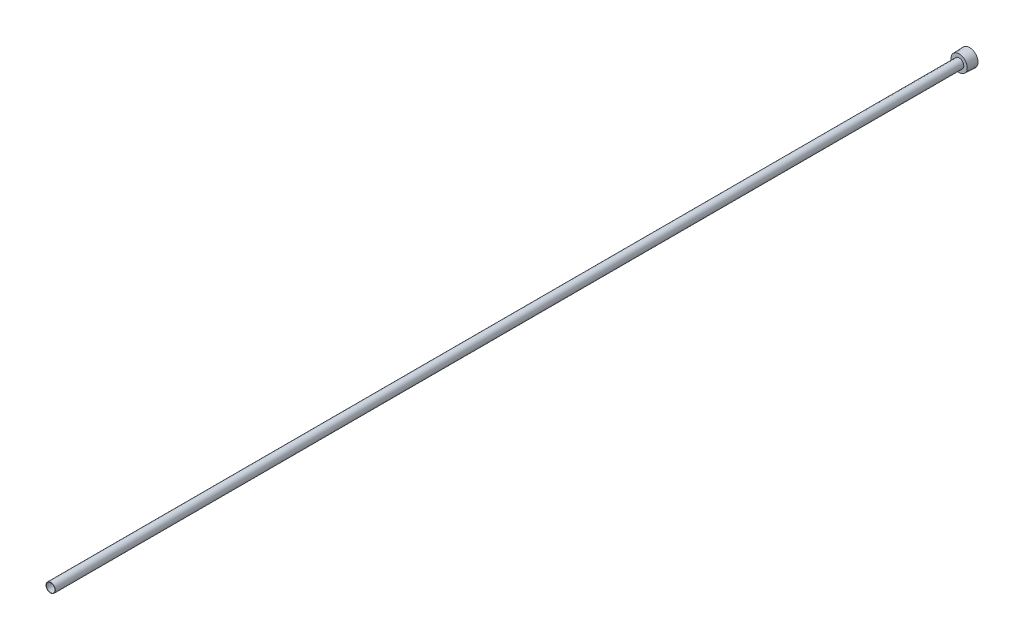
ISO-10303-21;
HEADER;
FILE_DESCRIPTION(('STEP AP214'),'2;1');
FILE_NAME('part.step','',(''),(''),'','','');
FILE_SCHEMA(('AUTOMOTIVE_DESIGN { 1 0 10303 214 1 1 1 1 }'));
ENDSEC;
DATA;
#1=APPLICATION_CONTEXT('core data for automotive mechanical design processes');
#2=APPLICATION_PROTOCOL_DEFINITION('international standard','automotive_design',2000,#1);
#3=PRODUCT_CONTEXT('',#1,'mechanical');
#4=PRODUCT('Part','Part','',(#3));
#5=PRODUCT_RELATED_PRODUCT_CATEGORY('part','',(#4));
#6=PRODUCT_DEFINITION_FORMATION('','',#4);
#7=PRODUCT_DEFINITION_CONTEXT('part definition',#1,'design');
#8=PRODUCT_DEFINITION('design','',#6,#7);
#9=PRODUCT_DEFINITION_SHAPE('','',#8);
#10=(LENGTH_UNIT() NAMED_UNIT(*) SI_UNIT(.MILLI.,.METRE.));
#11=(NAMED_UNIT(*) PLANE_ANGLE_UNIT() SI_UNIT($,.RADIAN.));
#12=(NAMED_UNIT(*) SI_UNIT($,.STERADIAN.) SOLID_ANGLE_UNIT());
#13=UNCERTAINTY_MEASURE_WITH_UNIT(LENGTH_MEASURE(1.E-05),#10,'distance_accuracy_value','');
#14=(GEOMETRIC_REPRESENTATION_CONTEXT(3) GLOBAL_UNCERTAINTY_ASSIGNED_CONTEXT((#13)) GLOBAL_UNIT_ASSIGNED_CONTEXT((#10,
#11,#12)) REPRESENTATION_CONTEXT('',''));
#15=CARTESIAN_POINT('',(0.,0.,0.));
#16=DIRECTION('',(0.,0.,1.));
#17=DIRECTION('',(1.,0.,0.));
#18=AXIS2_PLACEMENT_3D('',#15,#16,#17);
#19=CARTESIAN_POINT('',(0.,0.,0.));
#20=DIRECTION('',(0.,0.,1.));
#21=DIRECTION('',(1.,0.,0.));
#22=AXIS2_PLACEMENT_3D('',#19,#20,#21);
#23=CYLINDRICAL_SURFACE('',#22,4.318);
#24=CARTESIAN_POINT('',(0.,0.,914.4));
#25=DIRECTION('',(0.,0.,1.));
#26=DIRECTION('',(1.,0.,0.));
#27=AXIS2_PLACEMENT_3D('',#24,#25,#26);
#28=CIRCLE('',#27,4.318);
#29=CARTESIAN_POINT('',(4.318,0.,914.4));
#30=VERTEX_POINT('',#29);
#31=EDGE_CURVE('E142',#30,#30,#28,.T.);
#32=ORIENTED_EDGE('',*,*,#31,.T.);
#33=EDGE_LOOP('',(#32));
#34=FACE_BOUND('',#33,.T.);
#35=CARTESIAN_POINT('',(0.,0.,6.35));
#36=DIRECTION('',(0.,0.,-1.));
#37=DIRECTION('',(-1.,0.,0.));
#38=AXIS2_PLACEMENT_3D('',#35,#36,#37);
#39=CIRCLE('',#38,4.318);
#40=CARTESIAN_POINT('',(-4.318,0.,6.35));
#41=VERTEX_POINT('',#40);
#42=EDGE_CURVE('E37',#41,#41,#39,.F.);
#43=ORIENTED_EDGE('',*,*,#42,.F.);
#44=EDGE_LOOP('',(#43));
#45=FACE_BOUND('',#44,.T.);
#46=ADVANCED_FACE('F33',(#34,#45),#23,.F.);
#47=CARTESIAN_POINT('',(0.,0.,0.));
#48=DIRECTION('',(0.,0.,-1.));
#49=DIRECTION('',(-1.,0.,0.));
#50=AXIS2_PLACEMENT_3D('',#47,#48,#49);
#51=CONICAL_SURFACE('',#50,8.4709,0.0364599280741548);
#52=CARTESIAN_POINT('',(0.,0.,10.3124));
#53=DIRECTION('',(0.,0.,1.));
#54=DIRECTION('',(1.,0.,0.));
#55=AXIS2_PLACEMENT_3D('',#52,#53,#54);
#56=CIRCLE('',#55,8.09474394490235);
#57=CARTESIAN_POINT('',(8.09474394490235,0.,10.3124));
#58=VERTEX_POINT('',#57);
#59=EDGE_CURVE('E11',#58,#58,#56,.T.);
#60=ORIENTED_EDGE('',*,*,#59,.F.);
#61=EDGE_LOOP('',(#60));
#62=FACE_BOUND('',#61,.T.);
#63=CARTESIAN_POINT('',(0.,0.,0.));
#64=DIRECTION('',(0.,0.,1.));
#65=DIRECTION('',(1.,0.,0.));
#66=AXIS2_PLACEMENT_3D('',#63,#64,#65);
#67=CIRCLE('',#66,8.4709);
#68=CARTESIAN_POINT('',(8.4709,0.,0.));
#69=VERTEX_POINT('',#68);
#70=EDGE_CURVE('E145',#69,#69,#67,.T.);
#71=ORIENTED_EDGE('',*,*,#70,.T.);
#72=EDGE_LOOP('',(#71));
#73=FACE_BOUND('',#72,.T.);
#74=ADVANCED_FACE('F35',(#62,#73),#51,.T.);
#75=CARTESIAN_POINT('',(0.,8.09474394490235,10.3124));
#76=DIRECTION('',(0.,0.,-1.));
#77=DIRECTION('',(-1.,0.,0.));
#78=AXIS2_PLACEMENT_3D('',#75,#76,#77);
#79=PLANE('',#78);
#80=CARTESIAN_POINT('',(0.,0.,10.3124));
#81=DIRECTION('',(0.,0.,1.));
#82=DIRECTION('',(1.,0.,0.));
#83=AXIS2_PLACEMENT_3D('',#80,#81,#82);
#84=CIRCLE('',#83,4.6355);
#85=CARTESIAN_POINT('',(4.6355,0.,10.3124));
#86=VERTEX_POINT('',#85);
#87=EDGE_CURVE('E42',#86,#86,#84,.T.);
#88=ORIENTED_EDGE('',*,*,#87,.F.);
#89=EDGE_LOOP('',(#88));
#90=FACE_BOUND('',#89,.T.);
#91=ORIENTED_EDGE('',*,*,#59,.T.);
#92=EDGE_LOOP('',(#91));
#93=FACE_BOUND('',#92,.T.);
#94=ADVANCED_FACE('F156',(#90,#93),#79,.F.);
#95=CARTESIAN_POINT('',(0.,0.,168.793426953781));
#96=DIRECTION('',(0.,0.,1.));
#97=DIRECTION('',(1.,0.,0.));
#98=AXIS2_PLACEMENT_3D('',#95,#96,#97);
#99=CYLINDRICAL_SURFACE('',#98,4.63549999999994);
#100=CARTESIAN_POINT('',(0.,0.,914.4));
#101=DIRECTION('',(0.,0.,1.));
#102=DIRECTION('',(1.,0.,0.));
#103=AXIS2_PLACEMENT_3D('',#100,#101,#102);
#104=CIRCLE('',#103,4.63549999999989);
#105=CARTESIAN_POINT('',(4.63549999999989,0.,914.4));
#106=VERTEX_POINT('',#105);
#107=EDGE_CURVE('E148',#106,#106,#104,.T.);
#108=ORIENTED_EDGE('',*,*,#107,.F.);
#109=EDGE_LOOP('',(#108));
#110=FACE_BOUND('',#109,.T.);
#111=ORIENTED_EDGE('',*,*,#87,.T.);
#112=EDGE_LOOP('',(#111));
#113=FACE_BOUND('',#112,.T.);
#114=ADVANCED_FACE('F154',(#110,#113),#99,.T.);
#115=CARTESIAN_POINT('',(0.,4.63549999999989,914.4));
#116=DIRECTION('',(0.,0.,-1.));
#117=DIRECTION('',(-1.,0.,0.));
#118=AXIS2_PLACEMENT_3D('',#115,#116,#117);
#119=PLANE('',#118);
#120=ORIENTED_EDGE('',*,*,#31,.F.);
#121=EDGE_LOOP('',(#120));
#122=FACE_BOUND('',#121,.T.);
#123=ORIENTED_EDGE('',*,*,#107,.T.);
#124=EDGE_LOOP('',(#123));
#125=FACE_BOUND('',#124,.T.);
#126=ADVANCED_FACE('F167',(#122,#125),#119,.F.);
#127=CARTESIAN_POINT('',(0.,0.,0.));
#128=DIRECTION('',(0.,0.,1.));
#129=DIRECTION('',(1.,0.,0.));
#130=AXIS2_PLACEMENT_3D('',#127,#128,#129);
#131=PLANE('',#130);
#132=DIRECTION('',(0.,1.,0.));
#133=VECTOR('',#132,1.);
#134=CARTESIAN_POINT('',(-4.7625,-2.7496306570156,0.));
#135=LINE('',#134,#133);
#136=CARTESIAN_POINT('',(-4.7625,-2.7496306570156,0.));
#137=VERTEX_POINT('',#136);
#138=CARTESIAN_POINT('',(-4.7625,2.74963065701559,0.));
#139=VERTEX_POINT('',#138);
#140=EDGE_CURVE('E124',#137,#139,#135,.T.);
#141=ORIENTED_EDGE('',*,*,#140,.F.);
#142=DIRECTION('',(-0.866025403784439,0.5,0.));
#143=VECTOR('',#142,1.);
#144=CARTESIAN_POINT('',(0.,-5.49926131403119,0.));
#145=LINE('',#144,#143);
#146=CARTESIAN_POINT('',(0.,-5.49926131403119,0.));
#147=VERTEX_POINT('',#146);
#148=EDGE_CURVE('E49',#147,#137,#145,.T.);
#149=ORIENTED_EDGE('',*,*,#148,.F.);
#150=DIRECTION('',(-0.866025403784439,-0.5,0.));
#151=VECTOR('',#150,1.);
#152=CARTESIAN_POINT('',(4.7625,-2.74963065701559,0.));
#153=LINE('',#152,#151);
#154=CARTESIAN_POINT('',(4.7625,-2.74963065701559,0.));
#155=VERTEX_POINT('',#154);
#156=EDGE_CURVE('E133',#155,#147,#153,.T.);
#157=ORIENTED_EDGE('',*,*,#156,.F.);
#158=DIRECTION('',(0.,-1.,0.));
#159=VECTOR('',#158,1.);
#160=CARTESIAN_POINT('',(4.7625,2.74963065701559,0.));
#161=LINE('',#160,#159);
#162=CARTESIAN_POINT('',(4.7625,2.74963065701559,0.));
#163=VERTEX_POINT('',#162);
#164=EDGE_CURVE('E131',#163,#155,#161,.T.);
#165=ORIENTED_EDGE('',*,*,#164,.F.);
#166=DIRECTION('',(0.866025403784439,-0.5,0.));
#167=VECTOR('',#166,1.);
#168=CARTESIAN_POINT('',(0.,5.49926131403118,0.));
#169=LINE('',#168,#167);
#170=CARTESIAN_POINT('',(0.,5.49926131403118,0.));
#171=VERTEX_POINT('',#170);
#172=EDGE_CURVE('E97',#171,#163,#169,.T.);
#173=ORIENTED_EDGE('',*,*,#172,.F.);
#174=DIRECTION('',(0.866025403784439,0.5,0.));
#175=VECTOR('',#174,1.);
#176=CARTESIAN_POINT('',(-4.7625,2.74963065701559,0.));
#177=LINE('',#176,#175);
#178=EDGE_CURVE('E127',#139,#171,#177,.T.);
#179=ORIENTED_EDGE('',*,*,#178,.F.);
#180=EDGE_LOOP('',(#141,#149,#157,#165,#173,#179));
#181=FACE_BOUND('',#180,.T.);
#182=ORIENTED_EDGE('',*,*,#70,.F.);
#183=EDGE_LOOP('',(#182));
#184=FACE_BOUND('',#183,.T.);
#185=ADVANCED_FACE('F165',(#181,#184),#131,.F.);
#186=CARTESIAN_POINT('',(-4.7625,-2.7496306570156,6.35));
#187=DIRECTION('',(0.,0.,-1.));
#188=DIRECTION('',(-1.,0.,0.));
#189=AXIS2_PLACEMENT_3D('',#186,#187,#188);
#190=PLANE('',#189);
#191=DIRECTION('',(-0.866025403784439,0.5,0.));
#192=VECTOR('',#191,1.);
#193=CARTESIAN_POINT('',(0.,-5.49926131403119,6.35));
#194=LINE('',#193,#192);
#195=CARTESIAN_POINT('',(0.,-5.49926131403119,6.35));
#196=VERTEX_POINT('',#195);
#197=CARTESIAN_POINT('',(-4.7625,-2.7496306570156,6.35));
#198=VERTEX_POINT('',#197);
#199=EDGE_CURVE('E135',#196,#198,#194,.T.);
#200=ORIENTED_EDGE('',*,*,#199,.T.);
#201=DIRECTION('',(0.,1.,0.));
#202=VECTOR('',#201,1.);
#203=CARTESIAN_POINT('',(-4.7625,-2.7496306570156,6.35));
#204=LINE('',#203,#202);
#205=CARTESIAN_POINT('',(-4.7625,2.74963065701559,6.35));
#206=VERTEX_POINT('',#205);
#207=EDGE_CURVE('E118',#198,#206,#204,.T.);
#208=ORIENTED_EDGE('',*,*,#207,.T.);
#209=DIRECTION('',(0.866025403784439,0.5,0.));
#210=VECTOR('',#209,1.);
#211=CARTESIAN_POINT('',(-4.7625,2.74963065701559,6.35));
#212=LINE('',#211,#210);
#213=CARTESIAN_POINT('',(0.,5.49926131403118,6.35));
#214=VERTEX_POINT('',#213);
#215=EDGE_CURVE('E116',#206,#214,#212,.T.);
#216=ORIENTED_EDGE('',*,*,#215,.T.);
#217=DIRECTION('',(0.866025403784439,-0.5,0.));
#218=VECTOR('',#217,1.);
#219=CARTESIAN_POINT('',(0.,5.49926131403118,6.35));
#220=LINE('',#219,#218);
#221=CARTESIAN_POINT('',(4.7625,2.74963065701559,6.35));
#222=VERTEX_POINT('',#221);
#223=EDGE_CURVE('E94',#214,#222,#220,.T.);
#224=ORIENTED_EDGE('',*,*,#223,.T.);
#225=DIRECTION('',(0.,-1.,0.));
#226=VECTOR('',#225,1.);
#227=CARTESIAN_POINT('',(4.7625,2.74963065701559,6.35));
#228=LINE('',#227,#226);
#229=CARTESIAN_POINT('',(4.7625,-2.74963065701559,6.35));
#230=VERTEX_POINT('',#229);
#231=EDGE_CURVE('E105',#222,#230,#228,.T.);
#232=ORIENTED_EDGE('',*,*,#231,.T.);
#233=DIRECTION('',(-0.866025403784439,-0.5,0.));
#234=VECTOR('',#233,1.);
#235=CARTESIAN_POINT('',(4.7625,-2.74963065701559,6.35));
#236=LINE('',#235,#234);
#237=EDGE_CURVE('E109',#230,#196,#236,.T.);
#238=ORIENTED_EDGE('',*,*,#237,.T.);
#239=EDGE_LOOP('',(#200,#208,#216,#224,#232,#238));
#240=FACE_BOUND('',#239,.T.);
#241=ORIENTED_EDGE('',*,*,#42,.T.);
#242=EDGE_LOOP('',(#241));
#243=FACE_BOUND('',#242,.T.);
#244=ADVANCED_FACE('F112',(#240,#243),#190,.T.);
#245=CARTESIAN_POINT('',(0.,-5.49926131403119,6.35));
#246=DIRECTION('',(-0.5,-0.866025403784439,0.));
#247=DIRECTION('',(0.866025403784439,-0.5,0.));
#248=AXIS2_PLACEMENT_3D('',#245,#246,#247);
#249=PLANE('',#248);
#250=ORIENTED_EDGE('',*,*,#148,.T.);
#251=DIRECTION('',(0.,0.,-1.));
#252=VECTOR('',#251,1.);
#253=CARTESIAN_POINT('',(-4.7625,-2.7496306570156,6.35));
#254=LINE('',#253,#252);
#255=EDGE_CURVE('E79',#198,#137,#254,.T.);
#256=ORIENTED_EDGE('',*,*,#255,.F.);
#257=ORIENTED_EDGE('',*,*,#199,.F.);
#258=DIRECTION('',(0.,0.,-1.));
#259=VECTOR('',#258,1.);
#260=CARTESIAN_POINT('',(0.,-5.49926131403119,6.35));
#261=LINE('',#260,#259);
#262=EDGE_CURVE('E57',#196,#147,#261,.T.);
#263=ORIENTED_EDGE('',*,*,#262,.T.);
#264=EDGE_LOOP('',(#250,#256,#257,#263));
#265=FACE_BOUND('',#264,.T.);
#266=ADVANCED_FACE('F174',(#265),#249,.F.);
#267=CARTESIAN_POINT('',(4.7625,-2.74963065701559,6.35));
#268=DIRECTION('',(0.5,-0.866025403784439,0.));
#269=DIRECTION('',(0.866025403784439,0.5,0.));
#270=AXIS2_PLACEMENT_3D('',#267,#268,#269);
#271=PLANE('',#270);
#272=ORIENTED_EDGE('',*,*,#156,.T.);
#273=ORIENTED_EDGE('',*,*,#262,.F.);
#274=ORIENTED_EDGE('',*,*,#237,.F.);
#275=DIRECTION('',(0.,0.,-1.));
#276=VECTOR('',#275,1.);
#277=CARTESIAN_POINT('',(4.7625,-2.74963065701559,6.35));
#278=LINE('',#277,#276);
#279=EDGE_CURVE('E101',#230,#155,#278,.T.);
#280=ORIENTED_EDGE('',*,*,#279,.T.);
#281=EDGE_LOOP('',(#272,#273,#274,#280));
#282=FACE_BOUND('',#281,.T.);
#283=ADVANCED_FACE('F188',(#282),#271,.F.);
#284=CARTESIAN_POINT('',(4.7625,2.74963065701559,6.35));
#285=DIRECTION('',(1.,0.,0.));
#286=DIRECTION('',(0.,0.,-1.));
#287=AXIS2_PLACEMENT_3D('',#284,#285,#286);
#288=PLANE('',#287);
#289=ORIENTED_EDGE('',*,*,#164,.T.);
#290=ORIENTED_EDGE('',*,*,#279,.F.);
#291=ORIENTED_EDGE('',*,*,#231,.F.);
#292=DIRECTION('',(0.,0.,-1.));
#293=VECTOR('',#292,1.);
#294=CARTESIAN_POINT('',(4.7625,2.74963065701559,6.35));
#295=LINE('',#294,#293);
#296=EDGE_CURVE('E90',#222,#163,#295,.T.);
#297=ORIENTED_EDGE('',*,*,#296,.T.);
#298=EDGE_LOOP('',(#289,#290,#291,#297));
#299=FACE_BOUND('',#298,.T.);
#300=ADVANCED_FACE('F106',(#299),#288,.F.);
#301=CARTESIAN_POINT('',(0.,5.49926131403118,6.35));
#302=DIRECTION('',(0.5,0.866025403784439,0.));
#303=DIRECTION('',(-0.866025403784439,0.5,0.));
#304=AXIS2_PLACEMENT_3D('',#301,#302,#303);
#305=PLANE('',#304);
#306=ORIENTED_EDGE('',*,*,#172,.T.);
#307=ORIENTED_EDGE('',*,*,#296,.F.);
#308=ORIENTED_EDGE('',*,*,#223,.F.);
#309=DIRECTION('',(0.,0.,-1.));
#310=VECTOR('',#309,1.);
#311=CARTESIAN_POINT('',(0.,5.49926131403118,6.35));
#312=LINE('',#311,#310);
#313=EDGE_CURVE('E102',#214,#171,#312,.T.);
#314=ORIENTED_EDGE('',*,*,#313,.T.);
#315=EDGE_LOOP('',(#306,#307,#308,#314));
#316=FACE_BOUND('',#315,.T.);
#317=ADVANCED_FACE('F92',(#316),#305,.F.);
#318=CARTESIAN_POINT('',(-4.7625,2.74963065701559,6.35));
#319=DIRECTION('',(-0.5,0.866025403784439,0.));
#320=DIRECTION('',(-0.866025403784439,-0.5,0.));
#321=AXIS2_PLACEMENT_3D('',#318,#319,#320);
#322=PLANE('',#321);
#323=ORIENTED_EDGE('',*,*,#178,.T.);
#324=ORIENTED_EDGE('',*,*,#313,.F.);
#325=ORIENTED_EDGE('',*,*,#215,.F.);
#326=DIRECTION('',(0.,0.,-1.));
#327=VECTOR('',#326,1.);
#328=CARTESIAN_POINT('',(-4.7625,2.74963065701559,6.35));
#329=LINE('',#328,#327);
#330=EDGE_CURVE('E139',#206,#139,#329,.T.);
#331=ORIENTED_EDGE('',*,*,#330,.T.);
#332=EDGE_LOOP('',(#323,#324,#325,#331));
#333=FACE_BOUND('',#332,.T.);
#334=ADVANCED_FACE('F192',(#333),#322,.F.);
#335=CARTESIAN_POINT('',(-4.7625,-2.7496306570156,6.35));
#336=DIRECTION('',(-1.,0.,0.));
#337=DIRECTION('',(0.,0.,1.));
#338=AXIS2_PLACEMENT_3D('',#335,#336,#337);
#339=PLANE('',#338);
#340=ORIENTED_EDGE('',*,*,#140,.T.);
#341=ORIENTED_EDGE('',*,*,#330,.F.);
#342=ORIENTED_EDGE('',*,*,#207,.F.);
#343=ORIENTED_EDGE('',*,*,#255,.T.);
#344=EDGE_LOOP('',(#340,#341,#342,#343));
#345=FACE_BOUND('',#344,.T.);
#346=ADVANCED_FACE('F189',(#345),#339,.F.);
#347=CLOSED_SHELL('',(#46,#74,#94,#114,#126,#185,#244,#266,#283,#300,#317,#334,#346));
#348=MANIFOLD_SOLID_BREP('B2',#347);
#349=ADVANCED_BREP_SHAPE_REPRESENTATION('',(#18,#348),#14);
#350=SHAPE_DEFINITION_REPRESENTATION(#9,#349);
ENDSEC;
END-ISO-10303-21;
